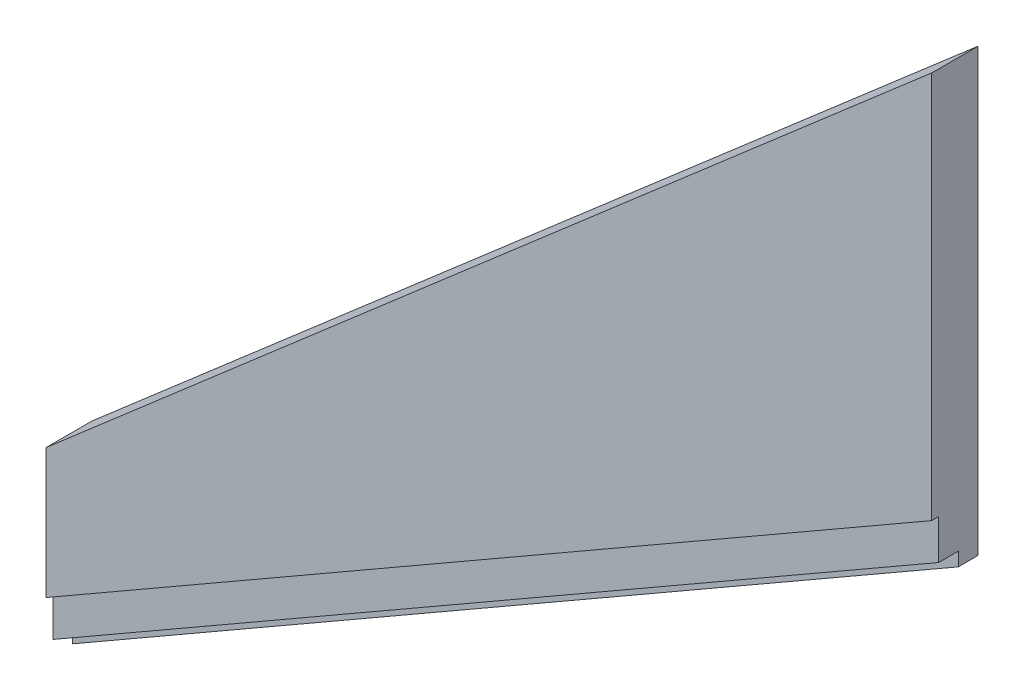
ISO-10303-21;
HEADER;
FILE_DESCRIPTION(('STEP AP214'),'2;1');
FILE_NAME('part.step','',(''),(''),'','','');
FILE_SCHEMA(('AUTOMOTIVE_DESIGN { 1 0 10303 214 1 1 1 1 }'));
ENDSEC;
DATA;
#1=APPLICATION_CONTEXT('core data for automotive mechanical design processes');
#2=APPLICATION_PROTOCOL_DEFINITION('international standard','automotive_design',2000,#1);
#3=PRODUCT_CONTEXT('',#1,'mechanical');
#4=PRODUCT('Part','Part','',(#3));
#5=PRODUCT_RELATED_PRODUCT_CATEGORY('part','',(#4));
#6=PRODUCT_DEFINITION_FORMATION('','',#4);
#7=PRODUCT_DEFINITION_CONTEXT('part definition',#1,'design');
#8=PRODUCT_DEFINITION('design','',#6,#7);
#9=PRODUCT_DEFINITION_SHAPE('','',#8);
#10=(LENGTH_UNIT() NAMED_UNIT(*) SI_UNIT(.MILLI.,.METRE.));
#11=(NAMED_UNIT(*) PLANE_ANGLE_UNIT() SI_UNIT($,.RADIAN.));
#12=(NAMED_UNIT(*) SI_UNIT($,.STERADIAN.) SOLID_ANGLE_UNIT());
#13=UNCERTAINTY_MEASURE_WITH_UNIT(LENGTH_MEASURE(1.E-05),#10,'distance_accuracy_value','');
#14=(GEOMETRIC_REPRESENTATION_CONTEXT(3) GLOBAL_UNCERTAINTY_ASSIGNED_CONTEXT((#13)) GLOBAL_UNIT_ASSIGNED_CONTEXT((#10,
#11,#12)) REPRESENTATION_CONTEXT('',''));
#15=CARTESIAN_POINT('',(0.,0.,0.));
#16=DIRECTION('',(0.,0.,1.));
#17=DIRECTION('',(1.,0.,0.));
#18=AXIS2_PLACEMENT_3D('',#15,#16,#17);
#19=CARTESIAN_POINT('',(0.,-226.78324876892,47.));
#20=DIRECTION('',(0.654788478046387,-0.755812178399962,0.));
#21=DIRECTION('',(0.755812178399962,0.654788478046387,0.));
#22=AXIS2_PLACEMENT_3D('',#19,#20,#21);
#23=PLANE('',#22);
#24=DIRECTION('',(-0.755812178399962,-0.654788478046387,0.));
#25=VECTOR('',#24,1.);
#26=CARTESIAN_POINT('',(0.,-226.78324876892,0.));
#27=LINE('',#26,#25);
#28=CARTESIAN_POINT('',(0.,-226.78324876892,0.));
#29=VERTEX_POINT('',#28);
#30=CARTESIAN_POINT('',(-900.,-1006.48705228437,0.));
#31=VERTEX_POINT('',#30);
#32=EDGE_CURVE('E100',#29,#31,#27,.T.);
#33=ORIENTED_EDGE('',*,*,#32,.T.);
#34=DIRECTION('',(0.,0.,-1.));
#35=VECTOR('',#34,1.);
#36=CARTESIAN_POINT('',(-900.,-1006.48705228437,47.));
#37=LINE('',#36,#35);
#38=CARTESIAN_POINT('',(-900.,-1006.48705228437,47.));
#39=VERTEX_POINT('',#38);
#40=EDGE_CURVE('E11',#39,#31,#37,.T.);
#41=ORIENTED_EDGE('',*,*,#40,.F.);
#42=DIRECTION('',(-0.755812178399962,-0.654788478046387,0.));
#43=VECTOR('',#42,1.);
#44=CARTESIAN_POINT('',(0.,-226.78324876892,47.));
#45=LINE('',#44,#43);
#46=CARTESIAN_POINT('',(0.,-226.78324876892,47.));
#47=VERTEX_POINT('',#46);
#48=EDGE_CURVE('E104',#47,#39,#45,.T.);
#49=ORIENTED_EDGE('',*,*,#48,.F.);
#50=DIRECTION('',(0.,0.,-1.));
#51=VECTOR('',#50,1.);
#52=CARTESIAN_POINT('',(0.,-226.78324876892,47.));
#53=LINE('',#52,#51);
#54=EDGE_CURVE('E156',#47,#29,#53,.T.);
#55=ORIENTED_EDGE('',*,*,#54,.T.);
#56=EDGE_LOOP('',(#33,#41,#49,#55));
#57=FACE_BOUND('',#56,.T.);
#58=ADVANCED_FACE('F31',(#57),#23,.F.);
#59=CARTESIAN_POINT('',(-900.,-1006.48705228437,47.));
#60=DIRECTION('',(1.,0.,0.));
#61=DIRECTION('',(0.,0.,-1.));
#62=AXIS2_PLACEMENT_3D('',#59,#60,#61);
#63=PLANE('',#62);
#64=DIRECTION('',(0.,-1.,0.));
#65=VECTOR('',#64,1.);
#66=CARTESIAN_POINT('',(-900.,-1006.48705228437,0.));
#67=LINE('',#66,#65);
#68=CARTESIAN_POINT('',(-900.,-1192.70821336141,0.));
#69=VERTEX_POINT('',#68);
#70=EDGE_CURVE('E105',#31,#69,#67,.T.);
#71=ORIENTED_EDGE('',*,*,#70,.T.);
#72=DIRECTION('',(0.,0.,-1.));
#73=VECTOR('',#72,1.);
#74=CARTESIAN_POINT('',(-900.,-1192.70821336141,20.));
#75=LINE('',#74,#73);
#76=CARTESIAN_POINT('',(-900.,-1192.70821336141,20.));
#77=VERTEX_POINT('',#76);
#78=EDGE_CURVE('E115',#77,#69,#75,.T.);
#79=ORIENTED_EDGE('',*,*,#78,.F.);
#80=DIRECTION('',(0.,1.,0.));
#81=VECTOR('',#80,1.);
#82=CARTESIAN_POINT('',(-900.,-1178.86451266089,20.));
#83=LINE('',#82,#81);
#84=CARTESIAN_POINT('',(-900.,-1178.86451266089,20.));
#85=VERTEX_POINT('',#84);
#86=EDGE_CURVE('E116',#77,#85,#83,.T.);
#87=ORIENTED_EDGE('',*,*,#86,.T.);
#88=DIRECTION('',(0.,0.,-1.));
#89=VECTOR('',#88,1.);
#90=CARTESIAN_POINT('',(-900.,-1178.86451266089,40.));
#91=LINE('',#90,#89);
#92=CARTESIAN_POINT('',(-900.,-1178.86451266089,40.));
#93=VERTEX_POINT('',#92);
#94=EDGE_CURVE('E142',#93,#85,#91,.T.);
#95=ORIENTED_EDGE('',*,*,#94,.F.);
#96=DIRECTION('',(0.,1.,0.));
#97=VECTOR('',#96,1.);
#98=CARTESIAN_POINT('',(-900.,-1138.48705228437,40.));
#99=LINE('',#98,#97);
#100=CARTESIAN_POINT('',(-900.,-1138.48705228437,40.));
#101=VERTEX_POINT('',#100);
#102=EDGE_CURVE('E138',#93,#101,#99,.T.);
#103=ORIENTED_EDGE('',*,*,#102,.T.);
#104=DIRECTION('',(0.,0.,-1.));
#105=VECTOR('',#104,1.);
#106=CARTESIAN_POINT('',(-900.,-1138.48705228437,47.));
#107=LINE('',#106,#105);
#108=CARTESIAN_POINT('',(-900.,-1138.48705228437,47.));
#109=VERTEX_POINT('',#108);
#110=EDGE_CURVE('E38',#109,#101,#107,.T.);
#111=ORIENTED_EDGE('',*,*,#110,.F.);
#112=DIRECTION('',(0.,-1.,0.));
#113=VECTOR('',#112,1.);
#114=CARTESIAN_POINT('',(-900.,-1006.48705228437,47.));
#115=LINE('',#114,#113);
#116=EDGE_CURVE('E150',#39,#109,#115,.T.);
#117=ORIENTED_EDGE('',*,*,#116,.F.);
#118=ORIENTED_EDGE('',*,*,#40,.T.);
#119=EDGE_LOOP('',(#71,#79,#87,#95,#103,#111,#117,#118));
#120=FACE_BOUND('',#119,.T.);
#121=ADVANCED_FACE('F171',(#120),#63,.F.);
#122=CARTESIAN_POINT('',(0.,-620.78030507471,47.));
#123=DIRECTION('',(-0.498620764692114,0.866820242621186,0.));
#124=DIRECTION('',(-0.866820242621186,-0.498620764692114,0.));
#125=AXIS2_PLACEMENT_3D('',#122,#123,#124);
#126=PLANE('',#125);
#127=ORIENTED_EDGE('',*,*,#110,.T.);
#128=DIRECTION('',(0.866820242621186,0.498620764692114,0.));
#129=VECTOR('',#128,1.);
#130=CARTESIAN_POINT('',(0.,-620.78030507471,40.));
#131=LINE('',#130,#129);
#132=CARTESIAN_POINT('',(0.,-620.78030507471,40.));
#133=VERTEX_POINT('',#132);
#134=EDGE_CURVE('E48',#101,#133,#131,.T.);
#135=ORIENTED_EDGE('',*,*,#134,.T.);
#136=DIRECTION('',(0.,0.,-1.));
#137=VECTOR('',#136,1.);
#138=CARTESIAN_POINT('',(0.,-620.78030507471,47.));
#139=LINE('',#138,#137);
#140=CARTESIAN_POINT('',(0.,-620.78030507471,47.));
#141=VERTEX_POINT('',#140);
#142=EDGE_CURVE('E158',#141,#133,#139,.T.);
#143=ORIENTED_EDGE('',*,*,#142,.F.);
#144=DIRECTION('',(0.866820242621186,0.498620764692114,0.));
#145=VECTOR('',#144,1.);
#146=CARTESIAN_POINT('',(0.,-620.78030507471,47.));
#147=LINE('',#146,#145);
#148=EDGE_CURVE('E152',#109,#141,#147,.T.);
#149=ORIENTED_EDGE('',*,*,#148,.F.);
#150=EDGE_LOOP('',(#127,#135,#143,#149));
#151=FACE_BOUND('',#150,.T.);
#152=ADVANCED_FACE('F177',(#151),#126,.F.);
#153=CARTESIAN_POINT('',(0.,-226.78324876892,47.));
#154=DIRECTION('',(-1.,0.,0.));
#155=DIRECTION('',(0.,-1.,0.));
#156=AXIS2_PLACEMENT_3D('',#153,#154,#155);
#157=PLANE('',#156);
#158=DIRECTION('',(0.,1.,0.));
#159=VECTOR('',#158,1.);
#160=CARTESIAN_POINT('',(0.,-226.78324876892,0.));
#161=LINE('',#160,#159);
#162=CARTESIAN_POINT('',(1.10211932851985E-13,-675.001466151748,0.));
#163=VERTEX_POINT('',#162);
#164=EDGE_CURVE('E94',#163,#29,#161,.T.);
#165=ORIENTED_EDGE('',*,*,#164,.T.);
#166=ORIENTED_EDGE('',*,*,#54,.F.);
#167=DIRECTION('',(0.,1.,0.));
#168=VECTOR('',#167,1.);
#169=CARTESIAN_POINT('',(0.,-226.78324876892,47.));
#170=LINE('',#169,#168);
#171=EDGE_CURVE('E154',#141,#47,#170,.T.);
#172=ORIENTED_EDGE('',*,*,#171,.F.);
#173=ORIENTED_EDGE('',*,*,#142,.T.);
#174=DIRECTION('',(0.,-1.,0.));
#175=VECTOR('',#174,1.);
#176=CARTESIAN_POINT('',(0.,-620.78030507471,40.));
#177=LINE('',#176,#175);
#178=CARTESIAN_POINT('',(-1.11112975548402E-13,-661.157765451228,40.));
#179=VERTEX_POINT('',#178);
#180=EDGE_CURVE('E132',#133,#179,#177,.T.);
#181=ORIENTED_EDGE('',*,*,#180,.T.);
#182=DIRECTION('',(0.,0.,-1.));
#183=VECTOR('',#182,1.);
#184=CARTESIAN_POINT('',(-1.11112975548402E-13,-661.157765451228,40.));
#185=LINE('',#184,#183);
#186=CARTESIAN_POINT('',(-1.11112975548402E-13,-661.157765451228,20.));
#187=VERTEX_POINT('',#186);
#188=EDGE_CURVE('E141',#179,#187,#185,.T.);
#189=ORIENTED_EDGE('',*,*,#188,.T.);
#190=DIRECTION('',(0.,-1.,0.));
#191=VECTOR('',#190,1.);
#192=CARTESIAN_POINT('',(-1.11112975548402E-13,-661.157765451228,20.));
#193=LINE('',#192,#191);
#194=CARTESIAN_POINT('',(1.10211932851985E-13,-675.001466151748,20.));
#195=VERTEX_POINT('',#194);
#196=EDGE_CURVE('E111',#187,#195,#193,.T.);
#197=ORIENTED_EDGE('',*,*,#196,.T.);
#198=DIRECTION('',(0.,0.,-1.));
#199=VECTOR('',#198,1.);
#200=CARTESIAN_POINT('',(1.10211932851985E-13,-675.001466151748,20.));
#201=LINE('',#200,#199);
#202=EDGE_CURVE('E108',#195,#163,#201,.T.);
#203=ORIENTED_EDGE('',*,*,#202,.T.);
#204=EDGE_LOOP('',(#165,#166,#172,#173,#181,#189,#197,#203));
#205=FACE_BOUND('',#204,.T.);
#206=ADVANCED_FACE('F109',(#205),#157,.F.);
#207=CARTESIAN_POINT('',(0.,-226.78324876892,47.));
#208=DIRECTION('',(0.,0.,1.));
#209=DIRECTION('',(1.,0.,0.));
#210=AXIS2_PLACEMENT_3D('',#207,#208,#209);
#211=PLANE('',#210);
#212=ORIENTED_EDGE('',*,*,#48,.T.);
#213=ORIENTED_EDGE('',*,*,#116,.T.);
#214=ORIENTED_EDGE('',*,*,#148,.T.);
#215=ORIENTED_EDGE('',*,*,#171,.T.);
#216=EDGE_LOOP('',(#212,#213,#214,#215));
#217=FACE_BOUND('',#216,.T.);
#218=ADVANCED_FACE('F176',(#217),#211,.T.);
#219=CARTESIAN_POINT('',(0.,-226.78324876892,0.));
#220=DIRECTION('',(0.,0.,1.));
#221=DIRECTION('',(1.,0.,0.));
#222=AXIS2_PLACEMENT_3D('',#219,#220,#221);
#223=PLANE('',#222);
#224=ORIENTED_EDGE('',*,*,#32,.F.);
#225=ORIENTED_EDGE('',*,*,#164,.F.);
#226=DIRECTION('',(-0.866820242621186,-0.498620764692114,0.));
#227=VECTOR('',#226,1.);
#228=CARTESIAN_POINT('',(-900.,-1192.70821336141,0.));
#229=LINE('',#228,#227);
#230=EDGE_CURVE('E98',#163,#69,#229,.T.);
#231=ORIENTED_EDGE('',*,*,#230,.T.);
#232=ORIENTED_EDGE('',*,*,#70,.F.);
#233=EDGE_LOOP('',(#224,#225,#231,#232));
#234=FACE_BOUND('',#233,.T.);
#235=ADVANCED_FACE('F96',(#234),#223,.F.);
#236=CARTESIAN_POINT('',(-900.,-1178.86451266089,40.));
#237=DIRECTION('',(0.498620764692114,-0.866820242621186,0.));
#238=DIRECTION('',(0.866820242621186,0.498620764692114,0.));
#239=AXIS2_PLACEMENT_3D('',#236,#237,#238);
#240=PLANE('',#239);
#241=DIRECTION('',(0.866820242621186,0.498620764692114,0.));
#242=VECTOR('',#241,1.);
#243=CARTESIAN_POINT('',(-1.11112975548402E-13,-661.157765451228,20.));
#244=LINE('',#243,#242);
#245=EDGE_CURVE('E120',#85,#187,#244,.T.);
#246=ORIENTED_EDGE('',*,*,#245,.T.);
#247=ORIENTED_EDGE('',*,*,#188,.F.);
#248=DIRECTION('',(-0.866820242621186,-0.498620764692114,0.));
#249=VECTOR('',#248,1.);
#250=CARTESIAN_POINT('',(-900.,-1178.86451266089,40.));
#251=LINE('',#250,#249);
#252=EDGE_CURVE('E135',#179,#93,#251,.T.);
#253=ORIENTED_EDGE('',*,*,#252,.T.);
#254=ORIENTED_EDGE('',*,*,#94,.T.);
#255=EDGE_LOOP('',(#246,#247,#253,#254));
#256=FACE_BOUND('',#255,.T.);
#257=ADVANCED_FACE('F166',(#256),#240,.T.);
#258=CARTESIAN_POINT('',(-900.,-1138.48705228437,40.));
#259=DIRECTION('',(0.,0.,1.));
#260=DIRECTION('',(1.,0.,0.));
#261=AXIS2_PLACEMENT_3D('',#258,#259,#260);
#262=PLANE('',#261);
#263=ORIENTED_EDGE('',*,*,#134,.F.);
#264=ORIENTED_EDGE('',*,*,#102,.F.);
#265=ORIENTED_EDGE('',*,*,#252,.F.);
#266=ORIENTED_EDGE('',*,*,#180,.F.);
#267=EDGE_LOOP('',(#263,#264,#265,#266));
#268=FACE_BOUND('',#267,.T.);
#269=ADVANCED_FACE('F163',(#268),#262,.T.);
#270=CARTESIAN_POINT('',(-900.,-1192.70821336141,20.));
#271=DIRECTION('',(0.498620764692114,-0.866820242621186,0.));
#272=DIRECTION('',(0.866820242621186,0.498620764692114,0.));
#273=AXIS2_PLACEMENT_3D('',#270,#271,#272);
#274=PLANE('',#273);
#275=ORIENTED_EDGE('',*,*,#230,.F.);
#276=ORIENTED_EDGE('',*,*,#202,.F.);
#277=DIRECTION('',(-0.866820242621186,-0.498620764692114,0.));
#278=VECTOR('',#277,1.);
#279=CARTESIAN_POINT('',(-900.,-1192.70821336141,20.));
#280=LINE('',#279,#278);
#281=EDGE_CURVE('E126',#195,#77,#280,.T.);
#282=ORIENTED_EDGE('',*,*,#281,.T.);
#283=ORIENTED_EDGE('',*,*,#78,.T.);
#284=EDGE_LOOP('',(#275,#276,#282,#283));
#285=FACE_BOUND('',#284,.T.);
#286=ADVANCED_FACE('F119',(#285),#274,.T.);
#287=CARTESIAN_POINT('',(-1.11112975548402E-13,-661.157765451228,20.));
#288=DIRECTION('',(0.,0.,1.));
#289=DIRECTION('',(1.,0.,0.));
#290=AXIS2_PLACEMENT_3D('',#287,#288,#289);
#291=PLANE('',#290);
#292=ORIENTED_EDGE('',*,*,#245,.F.);
#293=ORIENTED_EDGE('',*,*,#86,.F.);
#294=ORIENTED_EDGE('',*,*,#281,.F.);
#295=ORIENTED_EDGE('',*,*,#196,.F.);
#296=EDGE_LOOP('',(#292,#293,#294,#295));
#297=FACE_BOUND('',#296,.T.);
#298=ADVANCED_FACE('F169',(#297),#291,.T.);
#299=CLOSED_SHELL('',(#58,#121,#152,#206,#218,#235,#257,#269,#286,#298));
#300=MANIFOLD_SOLID_BREP('B2',#299);
#301=ADVANCED_BREP_SHAPE_REPRESENTATION('',(#18,#300),#14);
#302=SHAPE_DEFINITION_REPRESENTATION(#9,#301);
ENDSEC;
END-ISO-10303-21;
